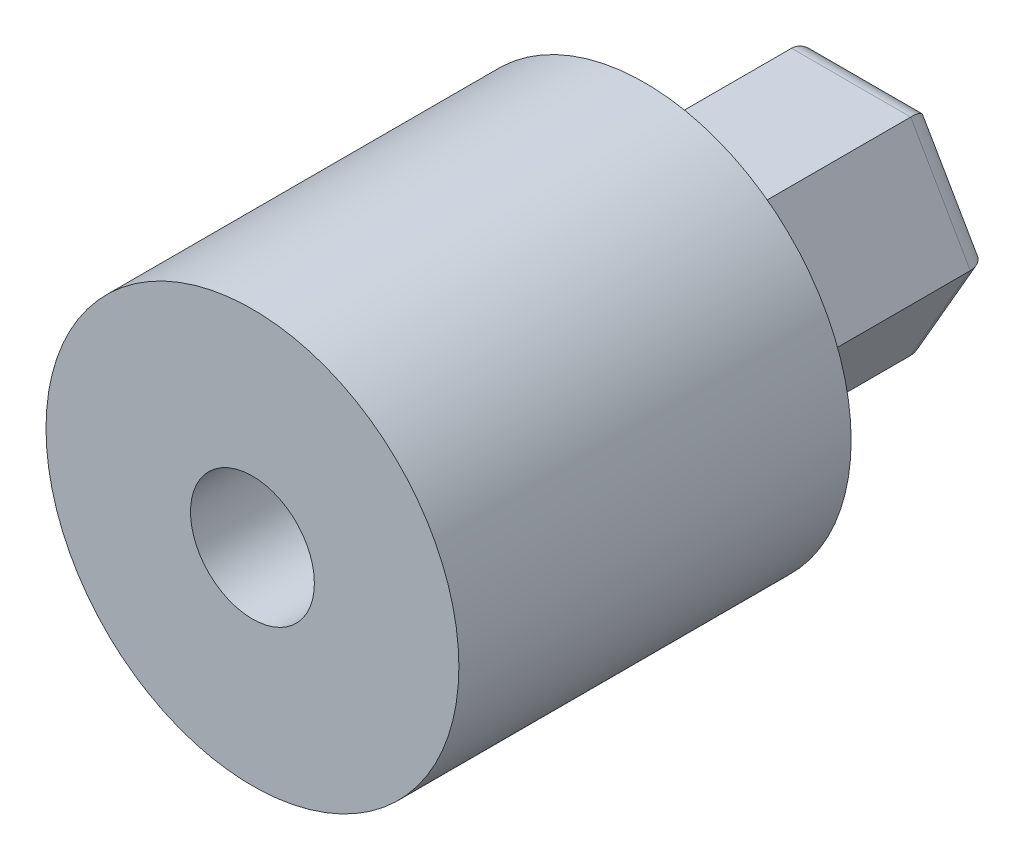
ISO-10303-21;
HEADER;
FILE_DESCRIPTION(('STEP AP214'),'2;1');
FILE_NAME('part.step','',(''),(''),'','','');
FILE_SCHEMA(('AUTOMOTIVE_DESIGN { 1 0 10303 214 1 1 1 1 }'));
ENDSEC;
DATA;
#1=APPLICATION_CONTEXT('core data for automotive mechanical design processes');
#2=APPLICATION_PROTOCOL_DEFINITION('international standard','automotive_design',2000,#1);
#3=PRODUCT_CONTEXT('',#1,'mechanical');
#4=PRODUCT('Part','Part','',(#3));
#5=PRODUCT_RELATED_PRODUCT_CATEGORY('part','',(#4));
#6=PRODUCT_DEFINITION_FORMATION('','',#4);
#7=PRODUCT_DEFINITION_CONTEXT('part definition',#1,'design');
#8=PRODUCT_DEFINITION('design','',#6,#7);
#9=PRODUCT_DEFINITION_SHAPE('','',#8);
#10=(LENGTH_UNIT() NAMED_UNIT(*) SI_UNIT(.MILLI.,.METRE.));
#11=(NAMED_UNIT(*) PLANE_ANGLE_UNIT() SI_UNIT($,.RADIAN.));
#12=(NAMED_UNIT(*) SI_UNIT($,.STERADIAN.) SOLID_ANGLE_UNIT());
#13=UNCERTAINTY_MEASURE_WITH_UNIT(LENGTH_MEASURE(1.E-05),#10,'distance_accuracy_value','');
#14=(GEOMETRIC_REPRESENTATION_CONTEXT(3) GLOBAL_UNCERTAINTY_ASSIGNED_CONTEXT((#13)) GLOBAL_UNIT_ASSIGNED_CONTEXT((#10,
#11,#12)) REPRESENTATION_CONTEXT('',''));
#15=CARTESIAN_POINT('',(0.,0.,0.));
#16=DIRECTION('',(0.,0.,1.));
#17=DIRECTION('',(1.,0.,0.));
#18=AXIS2_PLACEMENT_3D('',#15,#16,#17);
#19=CARTESIAN_POINT('',(1.44337567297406,2.5,15.));
#20=DIRECTION('',(0.,-1.,0.));
#21=DIRECTION('',(0.,0.,-1.));
#22=AXIS2_PLACEMENT_3D('',#19,#20,#21);
#23=PLANE('',#22);
#24=DIRECTION('',(-1.,0.,0.));
#25=VECTOR('',#24,1.);
#26=CARTESIAN_POINT('',(1.44337567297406,2.5,5.5));
#27=LINE('',#26,#25);
#28=CARTESIAN_POINT('',(1.44337567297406,2.5,5.5));
#29=VERTEX_POINT('',#28);
#30=CARTESIAN_POINT('',(-1.44337567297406,2.5,5.5));
#31=VERTEX_POINT('',#30);
#32=EDGE_CURVE('E116',#29,#31,#27,.T.);
#33=ORIENTED_EDGE('',*,*,#32,.F.);
#34=DIRECTION('',(0.,0.,-1.));
#35=VECTOR('',#34,1.);
#36=CARTESIAN_POINT('',(1.44337567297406,2.5,15.));
#37=LINE('',#36,#35);
#38=CARTESIAN_POINT('',(1.44337567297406,2.5,0.5));
#39=VERTEX_POINT('',#38);
#40=EDGE_CURVE('E103',#29,#39,#37,.T.);
#41=ORIENTED_EDGE('',*,*,#40,.T.);
#42=DIRECTION('',(-1.,0.,0.));
#43=VECTOR('',#42,1.);
#44=CARTESIAN_POINT('',(1.44337567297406,2.5,0.5));
#45=LINE('',#44,#43);
#46=CARTESIAN_POINT('',(-1.44337567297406,2.5,0.5));
#47=VERTEX_POINT('',#46);
#48=EDGE_CURVE('E175',#39,#47,#45,.T.);
#49=ORIENTED_EDGE('',*,*,#48,.T.);
#50=DIRECTION('',(0.,0.,-1.));
#51=VECTOR('',#50,1.);
#52=CARTESIAN_POINT('',(-1.44337567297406,2.5,15.));
#53=LINE('',#52,#51);
#54=EDGE_CURVE('E117',#31,#47,#53,.T.);
#55=ORIENTED_EDGE('',*,*,#54,.F.);
#56=EDGE_LOOP('',(#33,#41,#49,#55));
#57=FACE_BOUND('',#56,.T.);
#58=ADVANCED_FACE('F32',(#57),#23,.F.);
#59=CARTESIAN_POINT('',(-1.44337567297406,2.5,15.));
#60=DIRECTION('',(0.866025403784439,-0.5,0.));
#61=DIRECTION('',(0.5,0.866025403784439,0.));
#62=AXIS2_PLACEMENT_3D('',#59,#60,#61);
#63=PLANE('',#62);
#64=DIRECTION('',(-0.5,-0.866025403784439,0.));
#65=VECTOR('',#64,1.);
#66=CARTESIAN_POINT('',(-1.44337567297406,2.5,5.5));
#67=LINE('',#66,#65);
#68=CARTESIAN_POINT('',(-2.88675134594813,0.,5.5));
#69=VERTEX_POINT('',#68);
#70=EDGE_CURVE('E47',#31,#69,#67,.T.);
#71=ORIENTED_EDGE('',*,*,#70,.F.);
#72=ORIENTED_EDGE('',*,*,#54,.T.);
#73=DIRECTION('',(-0.5,-0.866025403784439,0.));
#74=VECTOR('',#73,1.);
#75=CARTESIAN_POINT('',(-1.44337567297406,2.5,0.5));
#76=LINE('',#75,#74);
#77=CARTESIAN_POINT('',(-2.88675134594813,0.,0.5));
#78=VERTEX_POINT('',#77);
#79=EDGE_CURVE('E177',#47,#78,#76,.T.);
#80=ORIENTED_EDGE('',*,*,#79,.T.);
#81=DIRECTION('',(0.,0.,-1.));
#82=VECTOR('',#81,1.);
#83=CARTESIAN_POINT('',(-2.88675134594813,0.,15.));
#84=LINE('',#83,#82);
#85=EDGE_CURVE('E155',#69,#78,#84,.T.);
#86=ORIENTED_EDGE('',*,*,#85,.F.);
#87=EDGE_LOOP('',(#71,#72,#80,#86));
#88=FACE_BOUND('',#87,.T.);
#89=ADVANCED_FACE('F223',(#88),#63,.F.);
#90=CARTESIAN_POINT('',(-2.88675134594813,0.,15.));
#91=DIRECTION('',(0.866025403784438,0.5,0.));
#92=DIRECTION('',(-0.5,0.866025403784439,0.));
#93=AXIS2_PLACEMENT_3D('',#90,#91,#92);
#94=PLANE('',#93);
#95=DIRECTION('',(0.5,-0.866025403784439,0.));
#96=VECTOR('',#95,1.);
#97=CARTESIAN_POINT('',(-2.88675134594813,0.,5.5));
#98=LINE('',#97,#96);
#99=CARTESIAN_POINT('',(-1.44337567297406,-2.5,5.5));
#100=VERTEX_POINT('',#99);
#101=EDGE_CURVE('E55',#69,#100,#98,.T.);
#102=ORIENTED_EDGE('',*,*,#101,.F.);
#103=ORIENTED_EDGE('',*,*,#85,.T.);
#104=DIRECTION('',(0.5,-0.866025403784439,0.));
#105=VECTOR('',#104,1.);
#106=CARTESIAN_POINT('',(-2.88675134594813,0.,0.5));
#107=LINE('',#106,#105);
#108=CARTESIAN_POINT('',(-1.44337567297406,-2.5,0.5));
#109=VERTEX_POINT('',#108);
#110=EDGE_CURVE('E180',#78,#109,#107,.T.);
#111=ORIENTED_EDGE('',*,*,#110,.T.);
#112=DIRECTION('',(0.,0.,-1.));
#113=VECTOR('',#112,1.);
#114=CARTESIAN_POINT('',(-1.44337567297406,-2.5,15.));
#115=LINE('',#114,#113);
#116=EDGE_CURVE('E153',#100,#109,#115,.T.);
#117=ORIENTED_EDGE('',*,*,#116,.F.);
#118=EDGE_LOOP('',(#102,#103,#111,#117));
#119=FACE_BOUND('',#118,.T.);
#120=ADVANCED_FACE('F222',(#119),#94,.F.);
#121=CARTESIAN_POINT('',(-1.44337567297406,-2.5,15.));
#122=DIRECTION('',(0.,1.,0.));
#123=DIRECTION('',(-1.,0.,0.));
#124=AXIS2_PLACEMENT_3D('',#121,#122,#123);
#125=PLANE('',#124);
#126=DIRECTION('',(1.,0.,0.));
#127=VECTOR('',#126,1.);
#128=CARTESIAN_POINT('',(-1.44337567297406,-2.5,5.5));
#129=LINE('',#128,#127);
#130=CARTESIAN_POINT('',(1.44337567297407,-2.5,5.5));
#131=VERTEX_POINT('',#130);
#132=EDGE_CURVE('E125',#100,#131,#129,.T.);
#133=ORIENTED_EDGE('',*,*,#132,.F.);
#134=ORIENTED_EDGE('',*,*,#116,.T.);
#135=DIRECTION('',(1.,0.,0.));
#136=VECTOR('',#135,1.);
#137=CARTESIAN_POINT('',(-1.44337567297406,-2.5,0.5));
#138=LINE('',#137,#136);
#139=CARTESIAN_POINT('',(1.44337567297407,-2.5,0.5));
#140=VERTEX_POINT('',#139);
#141=EDGE_CURVE('E40',#109,#140,#138,.T.);
#142=ORIENTED_EDGE('',*,*,#141,.T.);
#143=DIRECTION('',(0.,0.,-1.));
#144=VECTOR('',#143,1.);
#145=CARTESIAN_POINT('',(1.44337567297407,-2.5,15.));
#146=LINE('',#145,#144);
#147=EDGE_CURVE('E151',#131,#140,#146,.T.);
#148=ORIENTED_EDGE('',*,*,#147,.F.);
#149=EDGE_LOOP('',(#133,#134,#142,#148));
#150=FACE_BOUND('',#149,.T.);
#151=ADVANCED_FACE('F221',(#150),#125,.F.);
#152=CARTESIAN_POINT('',(1.44337567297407,-2.5,15.));
#153=DIRECTION('',(-0.866025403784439,0.5,0.));
#154=DIRECTION('',(-0.5,-0.866025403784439,0.));
#155=AXIS2_PLACEMENT_3D('',#152,#153,#154);
#156=PLANE('',#155);
#157=DIRECTION('',(0.5,0.866025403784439,0.));
#158=VECTOR('',#157,1.);
#159=CARTESIAN_POINT('',(1.44337567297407,-2.5,5.5));
#160=LINE('',#159,#158);
#161=CARTESIAN_POINT('',(2.88675134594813,0.,5.5));
#162=VERTEX_POINT('',#161);
#163=EDGE_CURVE('E124',#131,#162,#160,.T.);
#164=ORIENTED_EDGE('',*,*,#163,.F.);
#165=ORIENTED_EDGE('',*,*,#147,.T.);
#166=DIRECTION('',(0.5,0.866025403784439,0.));
#167=VECTOR('',#166,1.);
#168=CARTESIAN_POINT('',(1.44337567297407,-2.5,0.5));
#169=LINE('',#168,#167);
#170=CARTESIAN_POINT('',(2.88675134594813,0.,0.5));
#171=VERTEX_POINT('',#170);
#172=EDGE_CURVE('E158',#140,#171,#169,.T.);
#173=ORIENTED_EDGE('',*,*,#172,.T.);
#174=DIRECTION('',(0.,0.,-1.));
#175=VECTOR('',#174,1.);
#176=CARTESIAN_POINT('',(2.88675134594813,0.,15.));
#177=LINE('',#176,#175);
#178=EDGE_CURVE('E112',#162,#171,#177,.T.);
#179=ORIENTED_EDGE('',*,*,#178,.F.);
#180=EDGE_LOOP('',(#164,#165,#173,#179));
#181=FACE_BOUND('',#180,.T.);
#182=ADVANCED_FACE('F232',(#181),#156,.F.);
#183=CARTESIAN_POINT('',(2.88675134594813,0.,15.));
#184=DIRECTION('',(-0.866025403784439,-0.5,0.));
#185=DIRECTION('',(0.5,-0.866025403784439,0.));
#186=AXIS2_PLACEMENT_3D('',#183,#184,#185);
#187=PLANE('',#186);
#188=DIRECTION('',(-0.5,0.866025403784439,0.));
#189=VECTOR('',#188,1.);
#190=CARTESIAN_POINT('',(2.88675134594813,0.,5.5));
#191=LINE('',#190,#189);
#192=EDGE_CURVE('E11',#162,#29,#191,.T.);
#193=ORIENTED_EDGE('',*,*,#192,.F.);
#194=ORIENTED_EDGE('',*,*,#178,.T.);
#195=DIRECTION('',(-0.5,0.866025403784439,0.));
#196=VECTOR('',#195,1.);
#197=CARTESIAN_POINT('',(2.88675134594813,0.,0.5));
#198=LINE('',#197,#196);
#199=EDGE_CURVE('E108',#171,#39,#198,.T.);
#200=ORIENTED_EDGE('',*,*,#199,.T.);
#201=ORIENTED_EDGE('',*,*,#40,.F.);
#202=EDGE_LOOP('',(#193,#194,#200,#201));
#203=FACE_BOUND('',#202,.T.);
#204=ADVANCED_FACE('F105',(#203),#187,.F.);
#205=CARTESIAN_POINT('',(0.,0.,0.));
#206=DIRECTION('',(0.,0.,1.));
#207=DIRECTION('',(1.,0.,0.));
#208=AXIS2_PLACEMENT_3D('',#205,#206,#207);
#209=PLANE('',#208);
#210=DIRECTION('',(-0.5,0.866025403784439,0.));
#211=VECTOR('',#210,1.);
#212=CARTESIAN_POINT('',(1.73205080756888,1.,0.));
#213=LINE('',#212,#211);
#214=CARTESIAN_POINT('',(1.15470053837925,2.,0.));
#215=VERTEX_POINT('',#214);
#216=CARTESIAN_POINT('',(2.3094010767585,0.,0.));
#217=VERTEX_POINT('',#216);
#218=EDGE_CURVE('E169',#215,#217,#213,.F.);
#219=ORIENTED_EDGE('',*,*,#218,.T.);
#220=DIRECTION('',(0.5,0.866025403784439,0.));
#221=VECTOR('',#220,1.);
#222=CARTESIAN_POINT('',(1.73205080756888,-1.,0.));
#223=LINE('',#222,#221);
#224=CARTESIAN_POINT('',(1.15470053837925,-2.,0.));
#225=VERTEX_POINT('',#224);
#226=EDGE_CURVE('E171',#217,#225,#223,.F.);
#227=ORIENTED_EDGE('',*,*,#226,.T.);
#228=DIRECTION('',(1.,0.,0.));
#229=VECTOR('',#228,1.);
#230=CARTESIAN_POINT('',(0.,-2.,0.));
#231=LINE('',#230,#229);
#232=CARTESIAN_POINT('',(-1.15470053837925,-2.,0.));
#233=VERTEX_POINT('',#232);
#234=EDGE_CURVE('E161',#225,#233,#231,.F.);
#235=ORIENTED_EDGE('',*,*,#234,.T.);
#236=DIRECTION('',(0.5,-0.866025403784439,0.));
#237=VECTOR('',#236,1.);
#238=CARTESIAN_POINT('',(-1.73205080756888,-1.,0.));
#239=LINE('',#238,#237);
#240=CARTESIAN_POINT('',(-2.3094010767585,0.,0.));
#241=VERTEX_POINT('',#240);
#242=EDGE_CURVE('E163',#233,#241,#239,.F.);
#243=ORIENTED_EDGE('',*,*,#242,.T.);
#244=DIRECTION('',(-0.5,-0.866025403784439,0.));
#245=VECTOR('',#244,1.);
#246=CARTESIAN_POINT('',(-1.73205080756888,1.,0.));
#247=LINE('',#246,#245);
#248=CARTESIAN_POINT('',(-1.15470053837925,2.,0.));
#249=VERTEX_POINT('',#248);
#250=EDGE_CURVE('E165',#241,#249,#247,.F.);
#251=ORIENTED_EDGE('',*,*,#250,.T.);
#252=DIRECTION('',(-1.,0.,0.));
#253=VECTOR('',#252,1.);
#254=CARTESIAN_POINT('',(0.,2.,0.));
#255=LINE('',#254,#253);
#256=EDGE_CURVE('E167',#249,#215,#255,.F.);
#257=ORIENTED_EDGE('',*,*,#256,.T.);
#258=EDGE_LOOP('',(#219,#227,#235,#243,#251,#257));
#259=FACE_BOUND('',#258,.T.);
#260=CARTESIAN_POINT('',(0.,0.,0.));
#261=DIRECTION('',(0.,0.,-1.));
#262=DIRECTION('',(-1.,0.,0.));
#263=AXIS2_PLACEMENT_3D('',#260,#261,#262);
#264=CIRCLE('',#263,1.6);
#265=CARTESIAN_POINT('',(-1.6,0.,0.));
#266=VERTEX_POINT('',#265);
#267=EDGE_CURVE('E141',#266,#266,#264,.T.);
#268=ORIENTED_EDGE('',*,*,#267,.F.);
#269=EDGE_LOOP('',(#268));
#270=FACE_BOUND('',#269,.T.);
#271=ADVANCED_FACE('F210',(#259,#270),#209,.F.);
#272=CARTESIAN_POINT('',(0.,0.,2.));
#273=DIRECTION('',(0.,0.,-1.));
#274=DIRECTION('',(-1.,0.,0.));
#275=AXIS2_PLACEMENT_3D('',#272,#273,#274);
#276=CYLINDRICAL_SURFACE('',#275,1.6);
#277=CARTESIAN_POINT('',(0.,0.,2.));
#278=DIRECTION('',(0.,0.,-1.));
#279=DIRECTION('',(-1.,0.,0.));
#280=AXIS2_PLACEMENT_3D('',#277,#278,#279);
#281=CIRCLE('',#280,1.6);
#282=CARTESIAN_POINT('',(-1.6,0.,2.));
#283=VERTEX_POINT('',#282);
#284=EDGE_CURVE('E113',#283,#283,#281,.T.);
#285=ORIENTED_EDGE('',*,*,#284,.F.);
#286=EDGE_LOOP('',(#285));
#287=FACE_BOUND('',#286,.T.);
#288=ORIENTED_EDGE('',*,*,#267,.T.);
#289=EDGE_LOOP('',(#288));
#290=FACE_BOUND('',#289,.T.);
#291=ADVANCED_FACE('F264',(#287,#290),#276,.F.);
#292=CARTESIAN_POINT('',(0.,0.,2.));
#293=DIRECTION('',(0.,0.,-1.));
#294=DIRECTION('',(-1.,0.,0.));
#295=AXIS2_PLACEMENT_3D('',#292,#293,#294);
#296=PLANE('',#295);
#297=ORIENTED_EDGE('',*,*,#284,.T.);
#298=EDGE_LOOP('',(#297));
#299=FACE_BOUND('',#298,.T.);
#300=ADVANCED_FACE('F260',(#299),#296,.T.);
#301=CARTESIAN_POINT('',(-1.01036297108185,2.25,0.5));
#302=DIRECTION('',(-0.5,-0.866025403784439,0.));
#303=DIRECTION('',(0.866025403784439,-0.5,0.));
#304=AXIS2_PLACEMENT_3D('',#301,#302,#303);
#305=CYLINDRICAL_SURFACE('',#304,0.5);
#306=CARTESIAN_POINT('',(-1.15470053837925,2.,0.5));
#307=DIRECTION('',(-0.866025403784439,-0.5,0.));
#308=DIRECTION('',(0.5,-0.866025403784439,0.));
#309=AXIS2_PLACEMENT_3D('',#306,#307,#308);
#310=ELLIPSE('',#309,0.577350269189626,0.5);
#311=EDGE_CURVE('E195',#249,#47,#310,.F.);
#312=ORIENTED_EDGE('',*,*,#311,.F.);
#313=ORIENTED_EDGE('',*,*,#250,.F.);
#314=CARTESIAN_POINT('',(-2.3094010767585,0.,0.5));
#315=DIRECTION('',(0.,-1.,0.));
#316=DIRECTION('',(1.,0.,0.));
#317=AXIS2_PLACEMENT_3D('',#314,#315,#316);
#318=ELLIPSE('',#317,0.577350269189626,0.5);
#319=EDGE_CURVE('E145',#78,#241,#318,.T.);
#320=ORIENTED_EDGE('',*,*,#319,.F.);
#321=ORIENTED_EDGE('',*,*,#79,.F.);
#322=EDGE_LOOP('',(#312,#313,#320,#321));
#323=FACE_BOUND('',#322,.T.);
#324=ADVANCED_FACE('F34',(#323),#305,.T.);
#325=CARTESIAN_POINT('',(-2.45373864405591,0.25,0.5));
#326=DIRECTION('',(0.5,-0.866025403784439,0.));
#327=DIRECTION('',(0.866025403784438,0.5,0.));
#328=AXIS2_PLACEMENT_3D('',#325,#326,#327);
#329=CYLINDRICAL_SURFACE('',#328,0.5);
#330=ORIENTED_EDGE('',*,*,#319,.T.);
#331=ORIENTED_EDGE('',*,*,#242,.F.);
#332=CARTESIAN_POINT('',(-1.15470053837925,-2.,0.5));
#333=DIRECTION('',(0.866025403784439,-0.5,0.));
#334=DIRECTION('',(0.5,0.866025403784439,0.));
#335=AXIS2_PLACEMENT_3D('',#332,#333,#334);
#336=ELLIPSE('',#335,0.577350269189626,0.5);
#337=EDGE_CURVE('E192',#109,#233,#336,.T.);
#338=ORIENTED_EDGE('',*,*,#337,.F.);
#339=ORIENTED_EDGE('',*,*,#110,.F.);
#340=EDGE_LOOP('',(#330,#331,#338,#339));
#341=FACE_BOUND('',#340,.T.);
#342=ADVANCED_FACE('F202',(#341),#329,.T.);
#343=CARTESIAN_POINT('',(1.44337567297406,2.,0.5));
#344=DIRECTION('',(-1.,0.,0.));
#345=DIRECTION('',(0.,0.,1.));
#346=AXIS2_PLACEMENT_3D('',#343,#344,#345);
#347=CYLINDRICAL_SURFACE('',#346,0.5);
#348=ORIENTED_EDGE('',*,*,#311,.T.);
#349=ORIENTED_EDGE('',*,*,#48,.F.);
#350=CARTESIAN_POINT('',(1.15470053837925,2.,0.5));
#351=DIRECTION('',(-0.866025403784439,0.5,0.));
#352=DIRECTION('',(-0.5,-0.866025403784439,0.));
#353=AXIS2_PLACEMENT_3D('',#350,#351,#352);
#354=ELLIPSE('',#353,0.577350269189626,0.5);
#355=EDGE_CURVE('E189',#215,#39,#354,.F.);
#356=ORIENTED_EDGE('',*,*,#355,.F.);
#357=ORIENTED_EDGE('',*,*,#256,.F.);
#358=EDGE_LOOP('',(#348,#349,#356,#357));
#359=FACE_BOUND('',#358,.T.);
#360=ADVANCED_FACE('F225',(#359),#347,.T.);
#361=CARTESIAN_POINT('',(-1.44337567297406,-2.,0.5));
#362=DIRECTION('',(1.,0.,0.));
#363=DIRECTION('',(0.,1.,0.));
#364=AXIS2_PLACEMENT_3D('',#361,#362,#363);
#365=CYLINDRICAL_SURFACE('',#364,0.5);
#366=ORIENTED_EDGE('',*,*,#337,.T.);
#367=ORIENTED_EDGE('',*,*,#234,.F.);
#368=CARTESIAN_POINT('',(1.15470053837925,-2.,0.5));
#369=DIRECTION('',(0.866025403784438,0.5,0.));
#370=DIRECTION('',(0.5,-0.866025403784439,0.));
#371=AXIS2_PLACEMENT_3D('',#368,#369,#370);
#372=ELLIPSE('',#371,0.577350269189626,0.5);
#373=EDGE_CURVE('E187',#140,#225,#372,.T.);
#374=ORIENTED_EDGE('',*,*,#373,.F.);
#375=ORIENTED_EDGE('',*,*,#141,.F.);
#376=EDGE_LOOP('',(#366,#367,#374,#375));
#377=FACE_BOUND('',#376,.T.);
#378=ADVANCED_FACE('F217',(#377),#365,.T.);
#379=CARTESIAN_POINT('',(2.45373864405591,-0.25,0.5));
#380=DIRECTION('',(-0.5,0.866025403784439,0.));
#381=DIRECTION('',(-0.866025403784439,-0.5,0.));
#382=AXIS2_PLACEMENT_3D('',#379,#380,#381);
#383=CYLINDRICAL_SURFACE('',#382,0.5);
#384=ORIENTED_EDGE('',*,*,#355,.T.);
#385=ORIENTED_EDGE('',*,*,#199,.F.);
#386=CARTESIAN_POINT('',(2.3094010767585,0.,0.5));
#387=DIRECTION('',(0.,1.,0.));
#388=DIRECTION('',(-1.,0.,0.));
#389=AXIS2_PLACEMENT_3D('',#386,#387,#388);
#390=ELLIPSE('',#389,0.577350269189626,0.5);
#391=EDGE_CURVE('E119',#217,#171,#390,.F.);
#392=ORIENTED_EDGE('',*,*,#391,.F.);
#393=ORIENTED_EDGE('',*,*,#218,.F.);
#394=EDGE_LOOP('',(#384,#385,#392,#393));
#395=FACE_BOUND('',#394,.T.);
#396=ADVANCED_FACE('F228',(#395),#383,.T.);
#397=CARTESIAN_POINT('',(1.01036297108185,-2.25,0.5));
#398=DIRECTION('',(0.5,0.866025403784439,0.));
#399=DIRECTION('',(-0.866025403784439,0.5,0.));
#400=AXIS2_PLACEMENT_3D('',#397,#398,#399);
#401=CYLINDRICAL_SURFACE('',#400,0.5);
#402=ORIENTED_EDGE('',*,*,#373,.T.);
#403=ORIENTED_EDGE('',*,*,#226,.F.);
#404=ORIENTED_EDGE('',*,*,#391,.T.);
#405=ORIENTED_EDGE('',*,*,#172,.F.);
#406=EDGE_LOOP('',(#402,#403,#404,#405));
#407=FACE_BOUND('',#406,.T.);
#408=ADVANCED_FACE('F231',(#407),#401,.T.);
#409=CARTESIAN_POINT('',(0.,0.,5.5));
#410=DIRECTION('',(0.,0.,1.));
#411=DIRECTION('',(1.,0.,0.));
#412=AXIS2_PLACEMENT_3D('',#409,#410,#411);
#413=PLANE('',#412);
#414=CARTESIAN_POINT('',(0.,0.,5.5));
#415=DIRECTION('',(0.,0.,1.));
#416=DIRECTION('',(1.,0.,0.));
#417=AXIS2_PLACEMENT_3D('',#414,#415,#416);
#418=CIRCLE('',#417,5.);
#419=CARTESIAN_POINT('',(5.,0.,5.5));
#420=VERTEX_POINT('',#419);
#421=EDGE_CURVE('E128',#420,#420,#418,.T.);
#422=ORIENTED_EDGE('',*,*,#421,.F.);
#423=EDGE_LOOP('',(#422));
#424=FACE_BOUND('',#423,.T.);
#425=ORIENTED_EDGE('',*,*,#192,.T.);
#426=ORIENTED_EDGE('',*,*,#32,.T.);
#427=ORIENTED_EDGE('',*,*,#70,.T.);
#428=ORIENTED_EDGE('',*,*,#101,.T.);
#429=ORIENTED_EDGE('',*,*,#132,.T.);
#430=ORIENTED_EDGE('',*,*,#163,.T.);
#431=EDGE_LOOP('',(#425,#426,#427,#428,#429,#430));
#432=FACE_BOUND('',#431,.T.);
#433=ADVANCED_FACE('F122',(#424,#432),#413,.F.);
#434=CARTESIAN_POINT('',(0.,0.,5.5));
#435=DIRECTION('',(0.,0.,1.));
#436=DIRECTION('',(1.,0.,0.));
#437=AXIS2_PLACEMENT_3D('',#434,#435,#436);
#438=CYLINDRICAL_SURFACE('',#437,5.);
#439=ORIENTED_EDGE('',*,*,#421,.T.);
#440=EDGE_LOOP('',(#439));
#441=FACE_BOUND('',#440,.T.);
#442=CARTESIAN_POINT('',(0.,0.,15.));
#443=DIRECTION('',(0.,0.,1.));
#444=DIRECTION('',(1.,0.,0.));
#445=AXIS2_PLACEMENT_3D('',#442,#443,#444);
#446=CIRCLE('',#445,5.);
#447=CARTESIAN_POINT('',(5.,0.,15.));
#448=VERTEX_POINT('',#447);
#449=EDGE_CURVE('E132',#448,#448,#446,.T.);
#450=ORIENTED_EDGE('',*,*,#449,.F.);
#451=EDGE_LOOP('',(#450));
#452=FACE_BOUND('',#451,.T.);
#453=ADVANCED_FACE('F310',(#441,#452),#438,.T.);
#454=CARTESIAN_POINT('',(0.,0.,9.));
#455=DIRECTION('',(0.,0.,1.));
#456=DIRECTION('',(1.,0.,0.));
#457=AXIS2_PLACEMENT_3D('',#454,#455,#456);
#458=PLANE('',#457);
#459=CARTESIAN_POINT('',(0.,0.,9.));
#460=DIRECTION('',(0.,0.,1.));
#461=DIRECTION('',(1.,0.,0.));
#462=AXIS2_PLACEMENT_3D('',#459,#460,#461);
#463=CIRCLE('',#462,1.5);
#464=CARTESIAN_POINT('',(1.5,0.,9.));
#465=VERTEX_POINT('',#464);
#466=EDGE_CURVE('E138',#465,#465,#463,.T.);
#467=ORIENTED_EDGE('',*,*,#466,.T.);
#468=EDGE_LOOP('',(#467));
#469=FACE_BOUND('',#468,.T.);
#470=ADVANCED_FACE('F302',(#469),#458,.T.);
#471=CARTESIAN_POINT('',(0.,0.,9.));
#472=DIRECTION('',(0.,0.,1.));
#473=DIRECTION('',(1.,0.,0.));
#474=AXIS2_PLACEMENT_3D('',#471,#472,#473);
#475=CYLINDRICAL_SURFACE('',#474,1.5);
#476=ORIENTED_EDGE('',*,*,#466,.F.);
#477=EDGE_LOOP('',(#476));
#478=FACE_BOUND('',#477,.T.);
#479=CARTESIAN_POINT('',(0.,0.,15.));
#480=DIRECTION('',(0.,0.,1.));
#481=DIRECTION('',(1.,0.,0.));
#482=AXIS2_PLACEMENT_3D('',#479,#480,#481);
#483=CIRCLE('',#482,1.5);
#484=CARTESIAN_POINT('',(1.5,0.,15.));
#485=VERTEX_POINT('',#484);
#486=EDGE_CURVE('E142',#485,#485,#483,.T.);
#487=ORIENTED_EDGE('',*,*,#486,.T.);
#488=EDGE_LOOP('',(#487));
#489=FACE_BOUND('',#488,.T.);
#490=ADVANCED_FACE('F273',(#478,#489),#475,.F.);
#491=CARTESIAN_POINT('',(0.,0.,15.));
#492=DIRECTION('',(0.,0.,1.));
#493=DIRECTION('',(1.,0.,0.));
#494=AXIS2_PLACEMENT_3D('',#491,#492,#493);
#495=PLANE('',#494);
#496=ORIENTED_EDGE('',*,*,#486,.F.);
#497=EDGE_LOOP('',(#496));
#498=FACE_BOUND('',#497,.T.);
#499=ORIENTED_EDGE('',*,*,#449,.T.);
#500=EDGE_LOOP('',(#499));
#501=FACE_BOUND('',#500,.T.);
#502=ADVANCED_FACE('F276',(#498,#501),#495,.T.);
#503=CLOSED_SHELL('',(#58,#89,#120,#151,#182,#204,#271,#291,#300,#324,#342,#360,#378,#396,#408,
#433,#453,#470,#490,#502));
#504=MANIFOLD_SOLID_BREP('B2',#503);
#505=ADVANCED_BREP_SHAPE_REPRESENTATION('',(#18,#504),#14);
#506=SHAPE_DEFINITION_REPRESENTATION(#9,#505);
ENDSEC;
END-ISO-10303-21;
